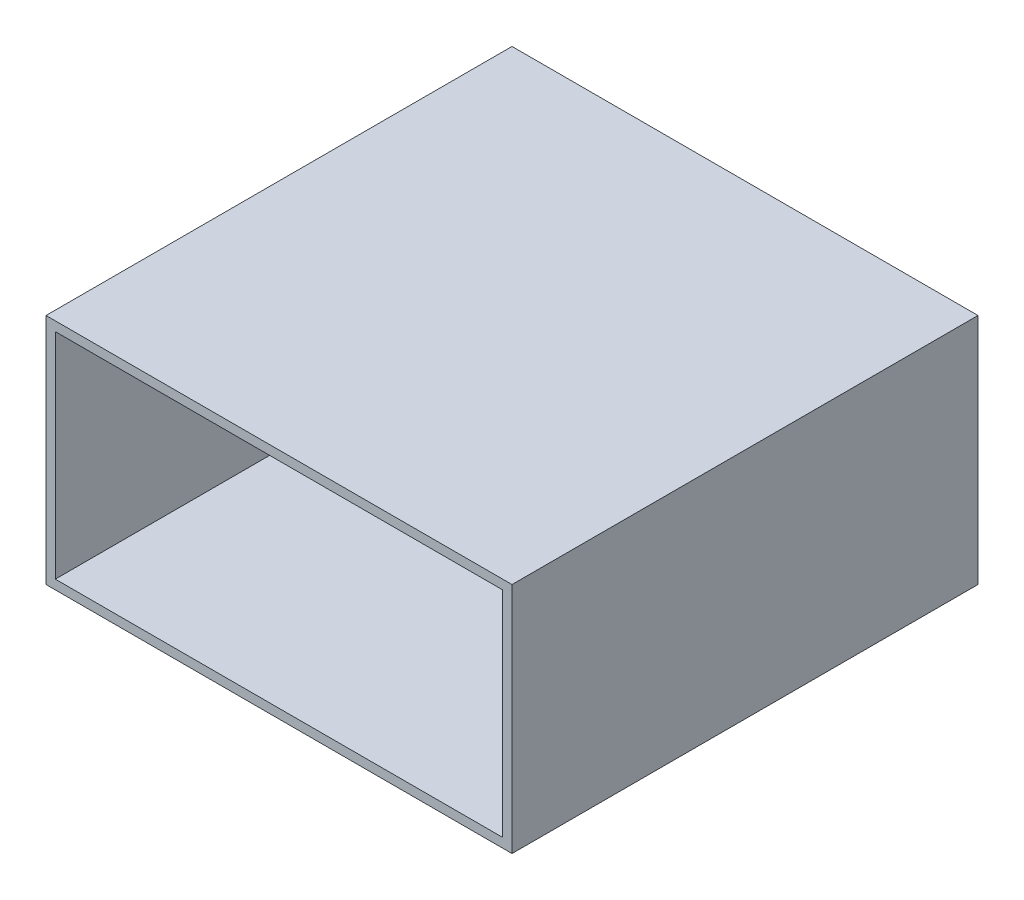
from build123d import *

# Parameters (mm, degrees)
SKETCH_1_W      = 100
SKETCH_1_H      = 100
EXTRUDE_1_DEPTH = 50
SHELL_1_T       = -2


with BuildPart() as part:
    # Sketch 1 → Extrude 1 (new body)
    with BuildSketch(Plane(origin=(0, 0, 0), x_dir=(1, 0, 0), z_dir=(0, 1, 0))):
        Rectangle(SKETCH_1_W, SKETCH_1_H)
    extrude(amount=EXTRUDE_1_DEPTH)

    # Shell 1
    shell_1_openings = [part.faces().sort_by_distance(p)[0] for p in [
        (0, 25, 50),
    ]]
    offset(amount=SHELL_1_T, openings=shell_1_openings, kind=Kind.INTERSECTION)


solid = part.part
